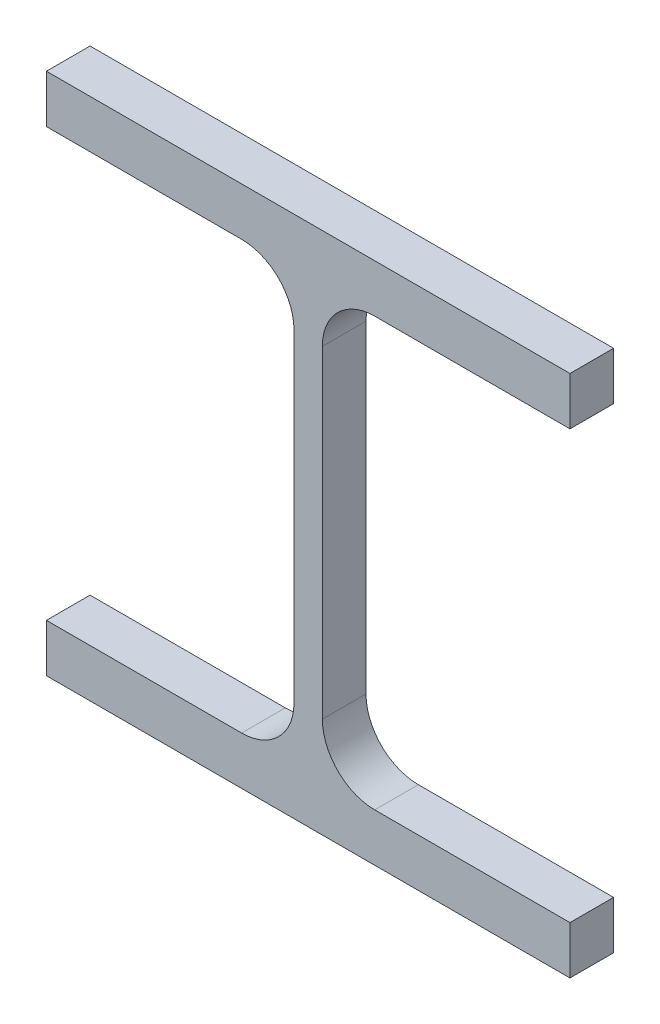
from build123d import *

# Parameters (mm, degrees)
SALIENTE_EXTRUIR1_DEPTH = 10


with BuildPart() as part:
    # Croquis1 → Saliente-Extruir1 (new body)
    with BuildSketch(Plane.XY):
        with BuildLine():
            Line((60, -60), (-60, -60))
            Line((-60, -60), (-60, -49))
            Line((-60, -49), (-15.25, -49))
            ThreePointArc((-15.25, -49), (-6.764718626, -45.485281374), (-3.25, -37))
            Line((-3.25, -37), (-3.25, 37))
            ThreePointArc((-3.25, 37), (-6.764718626, 45.485281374), (-15.25, 49))
            Line((-15.25, 49), (-60, 49))
            Line((-60, 49), (-60, 60))
            Line((-60, 60), (60, 60))
            Line((60, 60), (60, 49))
            Line((60, 49), (15.25, 49))
            ThreePointArc((15.25, 49), (6.764718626, 45.485281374), (3.25, 37))
            Line((3.25, 37), (3.25, -37))
            ThreePointArc((3.25, -37), (6.764718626, -45.485281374), (15.25, -49))
            Line((15.25, -49), (60, -49))
            Line((60, -49), (60, -60))
        make_face()
    extrude(amount=SALIENTE_EXTRUIR1_DEPTH)


solid = part.part
